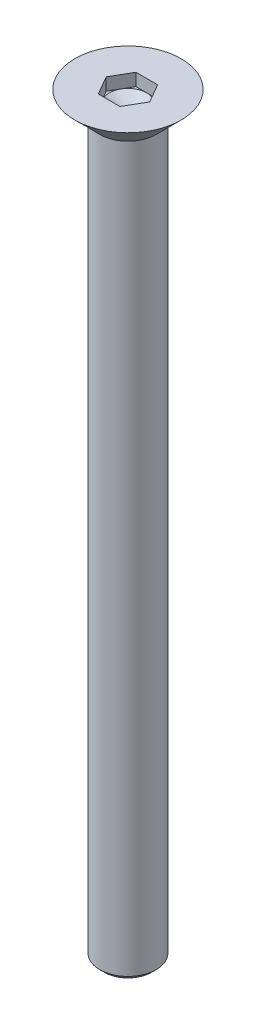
from build123d import *

# Parameters (mm, degrees)
ESQUISSE1_R             = 3
TIGE_DEPTH              = 80
CHANFREIN_D_ENTR_E_SIZE = 0.5
HEXAGONE_DEPTH          = 1.325


with BuildPart() as part:
    # Esquisse1 → Tige (new body)
    with BuildSketch(Plane(origin=(0, 0, 0), x_dir=(1, 0, 0), z_dir=(0, 1, 0))):
        with Locations(Location((0, 0, 0), (0, 0, 270))):
            Circle(ESQUISSE1_R)
    extrude(amount=-TIGE_DEPTH)

    # Chanfrein d_entr_e
    chanfrein_d_entr_e_edges = [part.edges().sort_by_distance(p)[0] for p in [
        (0, -80, -3),
    ]]
    chamfer(chanfrein_d_entr_e_edges, length=CHANFREIN_D_ENTR_E_SIZE)

    # Esquisse2 → T_te (revolve)
    with BuildSketch(Plane.XY, mode=Mode.PRIVATE) as t_te_sk:
        Polygon((0, 0), (5.65, 0), (3, -2.65), (0, -2.65), align=None)
    revolve(t_te_sk.sketch.rotate(Axis((0, 0, 0), (0, -1, 0)), 90), axis=Axis((0, 0, 0), (0, -1, 0)))

    # Esquisse3 → Per_age (revolve, cut)
    with BuildSketch(Plane.XY, mode=Mode.PRIVATE) as per_age_sk:
        Polygon((2, 0), (2, -1.325), (0, -2.479700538), (0, 0), align=None)
    revolve(per_age_sk.sketch.rotate(Axis((0, 0, 0), (0, -1, 0)), 90), axis=Axis((0, 0, 0), (0, -1, 0)), mode=Mode.SUBTRACT)

    # Esquisse5 → Hexagone (cut)
    with BuildSketch(Plane(origin=(0, 0, 0), x_dir=(1, 0, 0), z_dir=(0, 1, 0))):
        Polygon((1.154700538, 2), (-1.154700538, 2), (-2.309401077, 0), (-1.154700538, -2), (1.154700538, -2), (2.309401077, 0), align=None)
    extrude(amount=-HEXAGONE_DEPTH, mode=Mode.SUBTRACT)


solid = part.part
